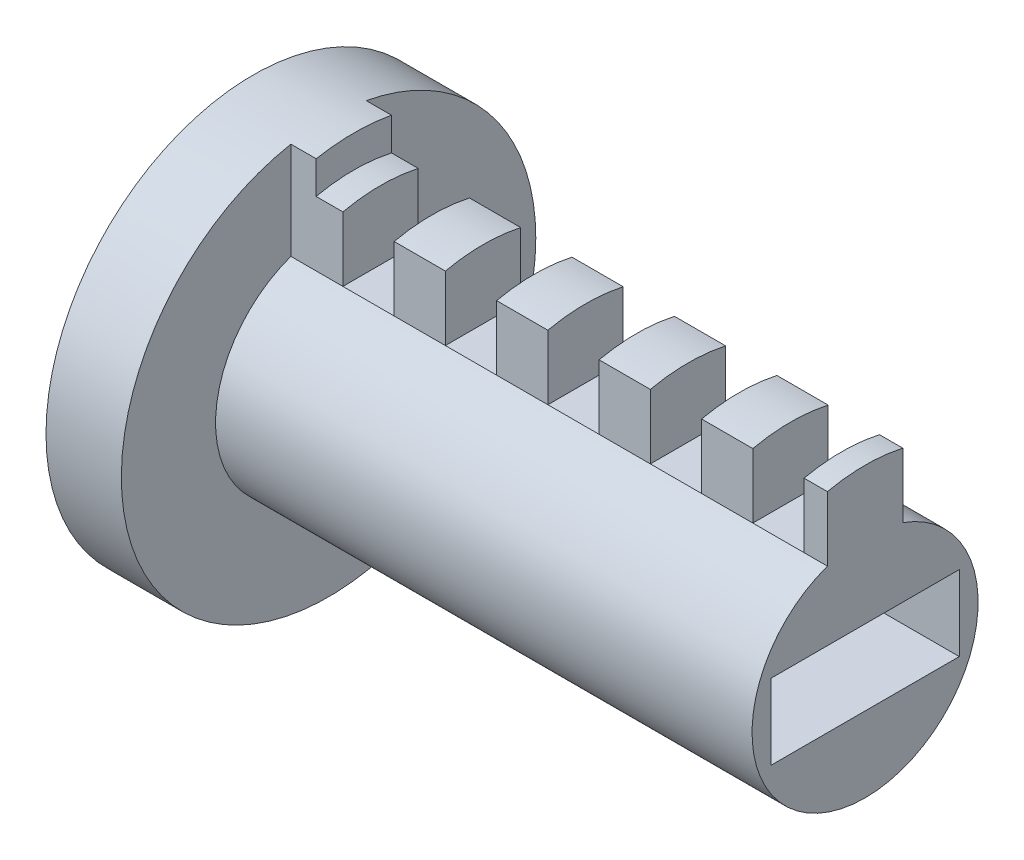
ISO-10303-21;
HEADER;
FILE_DESCRIPTION(('STEP AP214'),'2;1');
FILE_NAME('part.step','',(''),(''),'','','');
FILE_SCHEMA(('AUTOMOTIVE_DESIGN { 1 0 10303 214 1 1 1 1 }'));
ENDSEC;
DATA;
#1=APPLICATION_CONTEXT('core data for automotive mechanical design processes');
#2=APPLICATION_PROTOCOL_DEFINITION('international standard','automotive_design',2000,#1);
#3=PRODUCT_CONTEXT('',#1,'mechanical');
#4=PRODUCT('Part','Part','',(#3));
#5=PRODUCT_RELATED_PRODUCT_CATEGORY('part','',(#4));
#6=PRODUCT_DEFINITION_FORMATION('','',#4);
#7=PRODUCT_DEFINITION_CONTEXT('part definition',#1,'design');
#8=PRODUCT_DEFINITION('design','',#6,#7);
#9=PRODUCT_DEFINITION_SHAPE('','',#8);
#10=(LENGTH_UNIT() NAMED_UNIT(*) SI_UNIT(.MILLI.,.METRE.));
#11=(NAMED_UNIT(*) PLANE_ANGLE_UNIT() SI_UNIT($,.RADIAN.));
#12=(NAMED_UNIT(*) SI_UNIT($,.STERADIAN.) SOLID_ANGLE_UNIT());
#13=UNCERTAINTY_MEASURE_WITH_UNIT(LENGTH_MEASURE(1.E-05),#10,'distance_accuracy_value','');
#14=(GEOMETRIC_REPRESENTATION_CONTEXT(3) GLOBAL_UNCERTAINTY_ASSIGNED_CONTEXT((#13)) GLOBAL_UNIT_ASSIGNED_CONTEXT((#10,
#11,#12)) REPRESENTATION_CONTEXT('',''));
#15=CARTESIAN_POINT('',(0.,0.,0.));
#16=DIRECTION('',(0.,0.,1.));
#17=DIRECTION('',(1.,0.,0.));
#18=AXIS2_PLACEMENT_3D('',#15,#16,#17);
#19=CARTESIAN_POINT('',(38.1,0.,-2.54));
#20=DIRECTION('',(0.,0.,1.));
#21=DIRECTION('',(1.,0.,0.));
#22=AXIS2_PLACEMENT_3D('',#19,#20,#21);
#23=PLANE('',#22);
#24=DIRECTION('',(0.,-1.,0.));
#25=VECTOR('',#24,1.);
#26=CARTESIAN_POINT('',(6.9596,0.,-2.54));
#27=LINE('',#26,#25);
#28=CARTESIAN_POINT('',(6.9596,11.5346487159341,-2.54));
#29=VERTEX_POINT('',#28);
#30=CARTESIAN_POINT('',(6.9596,7.18420489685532,-2.54));
#31=VERTEX_POINT('',#30);
#32=EDGE_CURVE('E418',#29,#31,#27,.T.);
#33=ORIENTED_EDGE('',*,*,#32,.F.);
#34=DIRECTION('',(-1.,0.,0.));
#35=VECTOR('',#34,1.);
#36=CARTESIAN_POINT('',(38.1,11.5346487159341,-2.54));
#37=LINE('',#36,#35);
#38=CARTESIAN_POINT('',(10.414,11.5346487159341,-2.54));
#39=VERTEX_POINT('',#38);
#40=EDGE_CURVE('E566',#39,#29,#37,.T.);
#41=ORIENTED_EDGE('',*,*,#40,.F.);
#42=DIRECTION('',(0.,-1.,0.));
#43=VECTOR('',#42,1.);
#44=CARTESIAN_POINT('',(10.414,0.,-2.54));
#45=LINE('',#44,#43);
#46=CARTESIAN_POINT('',(10.414,7.18420489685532,-2.54));
#47=VERTEX_POINT('',#46);
#48=EDGE_CURVE('E408',#39,#47,#45,.T.);
#49=ORIENTED_EDGE('',*,*,#48,.T.);
#50=DIRECTION('',(-1.,0.,0.));
#51=VECTOR('',#50,1.);
#52=CARTESIAN_POINT('',(38.1,7.18420489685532,-2.54));
#53=LINE('',#52,#51);
#54=EDGE_CURVE('E574',#47,#31,#53,.T.);
#55=ORIENTED_EDGE('',*,*,#54,.T.);
#56=EDGE_LOOP('',(#33,#41,#49,#55));
#57=FACE_BOUND('',#56,.T.);
#58=ADVANCED_FACE('F42',(#57),#23,.F.);
#59=CARTESIAN_POINT('',(38.1,0.,0.));
#60=DIRECTION('',(-1.,0.,0.));
#61=DIRECTION('',(0.,0.,1.));
#62=AXIS2_PLACEMENT_3D('',#59,#60,#61);
#63=CYLINDRICAL_SURFACE('',#62,11.811);
#64=CARTESIAN_POINT('',(6.9596,0.,0.));
#65=DIRECTION('',(-1.,0.,0.));
#66=DIRECTION('',(0.,0.,1.));
#67=AXIS2_PLACEMENT_3D('',#64,#65,#66);
#68=CIRCLE('',#67,11.811);
#69=CARTESIAN_POINT('',(6.9596,11.5346487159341,2.54));
#70=VERTEX_POINT('',#69);
#71=EDGE_CURVE('E422',#70,#29,#68,.T.);
#72=ORIENTED_EDGE('',*,*,#71,.F.);
#73=DIRECTION('',(-1.,0.,0.));
#74=VECTOR('',#73,1.);
#75=CARTESIAN_POINT('',(38.1,11.5346487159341,2.54));
#76=LINE('',#75,#74);
#77=CARTESIAN_POINT('',(10.414,11.5346487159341,2.54));
#78=VERTEX_POINT('',#77);
#79=EDGE_CURVE('E313',#78,#70,#76,.T.);
#80=ORIENTED_EDGE('',*,*,#79,.F.);
#81=CARTESIAN_POINT('',(10.414,0.,0.));
#82=DIRECTION('',(-1.,0.,0.));
#83=DIRECTION('',(0.,0.,1.));
#84=AXIS2_PLACEMENT_3D('',#81,#82,#83);
#85=CIRCLE('',#84,11.811);
#86=EDGE_CURVE('E411',#78,#39,#85,.T.);
#87=ORIENTED_EDGE('',*,*,#86,.T.);
#88=ORIENTED_EDGE('',*,*,#40,.T.);
#89=EDGE_LOOP('',(#72,#80,#87,#88));
#90=FACE_BOUND('',#89,.T.);
#91=ADVANCED_FACE('F493',(#90),#63,.T.);
#92=CARTESIAN_POINT('',(38.1,0.,2.54));
#93=DIRECTION('',(0.,0.,1.));
#94=DIRECTION('',(1.,0.,0.));
#95=AXIS2_PLACEMENT_3D('',#92,#93,#94);
#96=PLANE('',#95);
#97=ORIENTED_EDGE('',*,*,#79,.T.);
#98=DIRECTION('',(0.,-1.,0.));
#99=VECTOR('',#98,1.);
#100=CARTESIAN_POINT('',(6.9596,0.,2.54));
#101=LINE('',#100,#99);
#102=CARTESIAN_POINT('',(6.9596,7.18420489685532,2.54));
#103=VERTEX_POINT('',#102);
#104=EDGE_CURVE('E50',#70,#103,#101,.T.);
#105=ORIENTED_EDGE('',*,*,#104,.T.);
#106=DIRECTION('',(-1.,0.,0.));
#107=VECTOR('',#106,1.);
#108=CARTESIAN_POINT('',(38.1,7.18420489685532,2.54));
#109=LINE('',#108,#107);
#110=CARTESIAN_POINT('',(10.414,7.18420489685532,2.54));
#111=VERTEX_POINT('',#110);
#112=EDGE_CURVE('E310',#111,#103,#109,.T.);
#113=ORIENTED_EDGE('',*,*,#112,.F.);
#114=DIRECTION('',(0.,-1.,0.));
#115=VECTOR('',#114,1.);
#116=CARTESIAN_POINT('',(10.414,0.,2.54));
#117=LINE('',#116,#115);
#118=EDGE_CURVE('E297',#78,#111,#117,.T.);
#119=ORIENTED_EDGE('',*,*,#118,.F.);
#120=EDGE_LOOP('',(#97,#105,#113,#119));
#121=FACE_BOUND('',#120,.T.);
#122=ADVANCED_FACE('F308',(#121),#96,.T.);
#123=DIRECTION('',(0.,-1.,0.));
#124=VECTOR('',#123,1.);
#125=CARTESIAN_POINT('',(13.8684,0.,-2.54));
#126=LINE('',#125,#124);
#127=CARTESIAN_POINT('',(13.8684,11.5346487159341,-2.54));
#128=VERTEX_POINT('',#127);
#129=CARTESIAN_POINT('',(13.8684,7.18420489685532,-2.54));
#130=VERTEX_POINT('',#129);
#131=EDGE_CURVE('E399',#128,#130,#126,.T.);
#132=ORIENTED_EDGE('',*,*,#131,.F.);
#133=CARTESIAN_POINT('',(17.3228,11.5346487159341,-2.54));
#134=VERTEX_POINT('',#133);
#135=EDGE_CURVE('E563',#134,#128,#37,.T.);
#136=ORIENTED_EDGE('',*,*,#135,.F.);
#137=DIRECTION('',(0.,-1.,0.));
#138=VECTOR('',#137,1.);
#139=CARTESIAN_POINT('',(17.3228,0.,-2.54));
#140=LINE('',#139,#138);
#141=CARTESIAN_POINT('',(17.3228,7.18420489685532,-2.54));
#142=VERTEX_POINT('',#141);
#143=EDGE_CURVE('E389',#134,#142,#140,.T.);
#144=ORIENTED_EDGE('',*,*,#143,.T.);
#145=EDGE_CURVE('E583',#142,#130,#53,.T.);
#146=ORIENTED_EDGE('',*,*,#145,.T.);
#147=EDGE_LOOP('',(#132,#136,#144,#146));
#148=FACE_BOUND('',#147,.T.);
#149=ADVANCED_FACE('F495',(#148),#23,.F.);
#150=CARTESIAN_POINT('',(13.8684,0.,0.));
#151=DIRECTION('',(-1.,0.,0.));
#152=DIRECTION('',(0.,0.,1.));
#153=AXIS2_PLACEMENT_3D('',#150,#151,#152);
#154=CIRCLE('',#153,11.811);
#155=CARTESIAN_POINT('',(13.8684,11.5346487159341,2.54));
#156=VERTEX_POINT('',#155);
#157=EDGE_CURVE('E403',#156,#128,#154,.T.);
#158=ORIENTED_EDGE('',*,*,#157,.F.);
#159=CARTESIAN_POINT('',(17.3228,11.5346487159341,2.54));
#160=VERTEX_POINT('',#159);
#161=EDGE_CURVE('E603',#160,#156,#76,.T.);
#162=ORIENTED_EDGE('',*,*,#161,.F.);
#163=CARTESIAN_POINT('',(17.3228,0.,0.));
#164=DIRECTION('',(-1.,0.,0.));
#165=DIRECTION('',(0.,0.,1.));
#166=AXIS2_PLACEMENT_3D('',#163,#164,#165);
#167=CIRCLE('',#166,11.811);
#168=EDGE_CURVE('E392',#160,#134,#167,.T.);
#169=ORIENTED_EDGE('',*,*,#168,.T.);
#170=ORIENTED_EDGE('',*,*,#135,.T.);
#171=EDGE_LOOP('',(#158,#162,#169,#170));
#172=FACE_BOUND('',#171,.T.);
#173=ADVANCED_FACE('F502',(#172),#63,.T.);
#174=ORIENTED_EDGE('',*,*,#161,.T.);
#175=DIRECTION('',(0.,-1.,0.));
#176=VECTOR('',#175,1.);
#177=CARTESIAN_POINT('',(13.8684,0.,2.54));
#178=LINE('',#177,#176);
#179=CARTESIAN_POINT('',(13.8684,7.18420489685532,2.54));
#180=VERTEX_POINT('',#179);
#181=EDGE_CURVE('E299',#156,#180,#178,.T.);
#182=ORIENTED_EDGE('',*,*,#181,.T.);
#183=CARTESIAN_POINT('',(17.3228,7.18420489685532,2.54));
#184=VERTEX_POINT('',#183);
#185=EDGE_CURVE('E322',#184,#180,#109,.T.);
#186=ORIENTED_EDGE('',*,*,#185,.F.);
#187=DIRECTION('',(0.,-1.,0.));
#188=VECTOR('',#187,1.);
#189=CARTESIAN_POINT('',(17.3228,0.,2.54));
#190=LINE('',#189,#188);
#191=EDGE_CURVE('E292',#160,#184,#190,.T.);
#192=ORIENTED_EDGE('',*,*,#191,.F.);
#193=EDGE_LOOP('',(#174,#182,#186,#192));
#194=FACE_BOUND('',#193,.T.);
#195=ADVANCED_FACE('F541',(#194),#96,.T.);
#196=DIRECTION('',(0.,-1.,0.));
#197=VECTOR('',#196,1.);
#198=CARTESIAN_POINT('',(20.7772,0.,-2.54));
#199=LINE('',#198,#197);
#200=CARTESIAN_POINT('',(20.7772,11.5346487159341,-2.54));
#201=VERTEX_POINT('',#200);
#202=CARTESIAN_POINT('',(20.7772,7.18420489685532,-2.54));
#203=VERTEX_POINT('',#202);
#204=EDGE_CURVE('E380',#201,#203,#199,.T.);
#205=ORIENTED_EDGE('',*,*,#204,.F.);
#206=CARTESIAN_POINT('',(24.2316,11.5346487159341,-2.54));
#207=VERTEX_POINT('',#206);
#208=EDGE_CURVE('E555',#207,#201,#37,.T.);
#209=ORIENTED_EDGE('',*,*,#208,.F.);
#210=DIRECTION('',(0.,-1.,0.));
#211=VECTOR('',#210,1.);
#212=CARTESIAN_POINT('',(24.2316,0.,-2.54));
#213=LINE('',#212,#211);
#214=CARTESIAN_POINT('',(24.2316,7.18420489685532,-2.54));
#215=VERTEX_POINT('',#214);
#216=EDGE_CURVE('E370',#207,#215,#213,.T.);
#217=ORIENTED_EDGE('',*,*,#216,.T.);
#218=EDGE_CURVE('E557',#215,#203,#53,.T.);
#219=ORIENTED_EDGE('',*,*,#218,.T.);
#220=EDGE_LOOP('',(#205,#209,#217,#219));
#221=FACE_BOUND('',#220,.T.);
#222=ADVANCED_FACE('F507',(#221),#23,.F.);
#223=CARTESIAN_POINT('',(20.7772,0.,0.));
#224=DIRECTION('',(-1.,0.,0.));
#225=DIRECTION('',(0.,0.,1.));
#226=AXIS2_PLACEMENT_3D('',#223,#224,#225);
#227=CIRCLE('',#226,11.811);
#228=CARTESIAN_POINT('',(20.7772,11.5346487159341,2.54));
#229=VERTEX_POINT('',#228);
#230=EDGE_CURVE('E384',#229,#201,#227,.T.);
#231=ORIENTED_EDGE('',*,*,#230,.F.);
#232=CARTESIAN_POINT('',(24.2316,11.5346487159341,2.54));
#233=VERTEX_POINT('',#232);
#234=EDGE_CURVE('E599',#233,#229,#76,.T.);
#235=ORIENTED_EDGE('',*,*,#234,.F.);
#236=CARTESIAN_POINT('',(24.2316,0.,0.));
#237=DIRECTION('',(-1.,0.,0.));
#238=DIRECTION('',(0.,0.,1.));
#239=AXIS2_PLACEMENT_3D('',#236,#237,#238);
#240=CIRCLE('',#239,11.811);
#241=EDGE_CURVE('E373',#233,#207,#240,.T.);
#242=ORIENTED_EDGE('',*,*,#241,.T.);
#243=ORIENTED_EDGE('',*,*,#208,.T.);
#244=EDGE_LOOP('',(#231,#235,#242,#243));
#245=FACE_BOUND('',#244,.T.);
#246=ADVANCED_FACE('F539',(#245),#63,.T.);
#247=ORIENTED_EDGE('',*,*,#234,.T.);
#248=DIRECTION('',(0.,-1.,0.));
#249=VECTOR('',#248,1.);
#250=CARTESIAN_POINT('',(20.7772,0.,2.54));
#251=LINE('',#250,#249);
#252=CARTESIAN_POINT('',(20.7772,7.18420489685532,2.54));
#253=VERTEX_POINT('',#252);
#254=EDGE_CURVE('E294',#229,#253,#251,.T.);
#255=ORIENTED_EDGE('',*,*,#254,.T.);
#256=CARTESIAN_POINT('',(24.2316,7.18420489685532,2.54));
#257=VERTEX_POINT('',#256);
#258=EDGE_CURVE('E601',#257,#253,#109,.T.);
#259=ORIENTED_EDGE('',*,*,#258,.F.);
#260=DIRECTION('',(0.,-1.,0.));
#261=VECTOR('',#260,1.);
#262=CARTESIAN_POINT('',(24.2316,0.,2.54));
#263=LINE('',#262,#261);
#264=EDGE_CURVE('E287',#233,#257,#263,.T.);
#265=ORIENTED_EDGE('',*,*,#264,.F.);
#266=EDGE_LOOP('',(#247,#255,#259,#265));
#267=FACE_BOUND('',#266,.T.);
#268=ADVANCED_FACE('F530',(#267),#96,.T.);
#269=DIRECTION('',(0.,-1.,0.));
#270=VECTOR('',#269,1.);
#271=CARTESIAN_POINT('',(27.686,0.,-2.54));
#272=LINE('',#271,#270);
#273=CARTESIAN_POINT('',(27.686,11.5346487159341,-2.54));
#274=VERTEX_POINT('',#273);
#275=CARTESIAN_POINT('',(27.686,7.18420489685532,-2.54));
#276=VERTEX_POINT('',#275);
#277=EDGE_CURVE('E361',#274,#276,#272,.T.);
#278=ORIENTED_EDGE('',*,*,#277,.F.);
#279=CARTESIAN_POINT('',(31.1404,11.5346487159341,-2.54));
#280=VERTEX_POINT('',#279);
#281=EDGE_CURVE('E281',#280,#274,#37,.T.);
#282=ORIENTED_EDGE('',*,*,#281,.F.);
#283=DIRECTION('',(0.,-1.,0.));
#284=VECTOR('',#283,1.);
#285=CARTESIAN_POINT('',(31.1404,0.,-2.54));
#286=LINE('',#285,#284);
#287=CARTESIAN_POINT('',(31.1404,7.18420489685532,-2.54));
#288=VERTEX_POINT('',#287);
#289=EDGE_CURVE('E351',#280,#288,#286,.T.);
#290=ORIENTED_EDGE('',*,*,#289,.T.);
#291=EDGE_CURVE('E263',#288,#276,#53,.T.);
#292=ORIENTED_EDGE('',*,*,#291,.T.);
#293=EDGE_LOOP('',(#278,#282,#290,#292));
#294=FACE_BOUND('',#293,.T.);
#295=ADVANCED_FACE('F521',(#294),#23,.F.);
#296=CARTESIAN_POINT('',(27.686,0.,0.));
#297=DIRECTION('',(-1.,0.,0.));
#298=DIRECTION('',(0.,0.,1.));
#299=AXIS2_PLACEMENT_3D('',#296,#297,#298);
#300=CIRCLE('',#299,11.811);
#301=CARTESIAN_POINT('',(27.686,11.5346487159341,2.54));
#302=VERTEX_POINT('',#301);
#303=EDGE_CURVE('E365',#302,#274,#300,.T.);
#304=ORIENTED_EDGE('',*,*,#303,.F.);
#305=CARTESIAN_POINT('',(31.1404,11.5346487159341,2.54));
#306=VERTEX_POINT('',#305);
#307=EDGE_CURVE('E279',#306,#302,#76,.T.);
#308=ORIENTED_EDGE('',*,*,#307,.F.);
#309=CARTESIAN_POINT('',(31.1404,0.,0.));
#310=DIRECTION('',(-1.,0.,0.));
#311=DIRECTION('',(0.,0.,1.));
#312=AXIS2_PLACEMENT_3D('',#309,#310,#311);
#313=CIRCLE('',#312,11.811);
#314=EDGE_CURVE('E354',#306,#280,#313,.T.);
#315=ORIENTED_EDGE('',*,*,#314,.T.);
#316=ORIENTED_EDGE('',*,*,#281,.T.);
#317=EDGE_LOOP('',(#304,#308,#315,#316));
#318=FACE_BOUND('',#317,.T.);
#319=ADVANCED_FACE('F527',(#318),#63,.T.);
#320=ORIENTED_EDGE('',*,*,#307,.T.);
#321=DIRECTION('',(0.,-1.,0.));
#322=VECTOR('',#321,1.);
#323=CARTESIAN_POINT('',(27.686,0.,2.54));
#324=LINE('',#323,#322);
#325=CARTESIAN_POINT('',(27.686,7.18420489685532,2.54));
#326=VERTEX_POINT('',#325);
#327=EDGE_CURVE('E289',#302,#326,#324,.T.);
#328=ORIENTED_EDGE('',*,*,#327,.T.);
#329=CARTESIAN_POINT('',(31.1404,7.18420489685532,2.54));
#330=VERTEX_POINT('',#329);
#331=EDGE_CURVE('E697',#330,#326,#109,.T.);
#332=ORIENTED_EDGE('',*,*,#331,.F.);
#333=DIRECTION('',(0.,-1.,0.));
#334=VECTOR('',#333,1.);
#335=CARTESIAN_POINT('',(31.1404,0.,2.54));
#336=LINE('',#335,#334);
#337=EDGE_CURVE('E271',#306,#330,#336,.T.);
#338=ORIENTED_EDGE('',*,*,#337,.F.);
#339=EDGE_LOOP('',(#320,#328,#332,#338));
#340=FACE_BOUND('',#339,.T.);
#341=ADVANCED_FACE('F519',(#340),#96,.T.);
#342=CARTESIAN_POINT('',(36.1696,11.5346487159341,-2.54));
#343=VERTEX_POINT('',#342);
#344=CARTESIAN_POINT('',(34.5948,11.5346487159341,-2.54));
#345=VERTEX_POINT('',#344);
#346=EDGE_CURVE('E280',#343,#345,#37,.T.);
#347=ORIENTED_EDGE('',*,*,#346,.F.);
#348=DIRECTION('',(0.,-1.,0.));
#349=VECTOR('',#348,1.);
#350=CARTESIAN_POINT('',(36.1696,0.,-2.54));
#351=LINE('',#350,#349);
#352=CARTESIAN_POINT('',(36.1696,7.18420489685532,-2.54));
#353=VERTEX_POINT('',#352);
#354=EDGE_CURVE('E458',#343,#353,#351,.T.);
#355=ORIENTED_EDGE('',*,*,#354,.T.);
#356=CARTESIAN_POINT('',(34.5948,7.18420489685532,-2.54));
#357=VERTEX_POINT('',#356);
#358=EDGE_CURVE('E259',#353,#357,#53,.T.);
#359=ORIENTED_EDGE('',*,*,#358,.T.);
#360=DIRECTION('',(0.,-1.,0.));
#361=VECTOR('',#360,1.);
#362=CARTESIAN_POINT('',(34.5948,0.,-2.54));
#363=LINE('',#362,#361);
#364=EDGE_CURVE('E342',#345,#357,#363,.T.);
#365=ORIENTED_EDGE('',*,*,#364,.F.);
#366=EDGE_LOOP('',(#347,#355,#359,#365));
#367=FACE_BOUND('',#366,.T.);
#368=ADVANCED_FACE('F510',(#367),#23,.F.);
#369=CARTESIAN_POINT('',(36.1696,11.5346487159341,2.54));
#370=VERTEX_POINT('',#369);
#371=CARTESIAN_POINT('',(34.5948,11.5346487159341,2.54));
#372=VERTEX_POINT('',#371);
#373=EDGE_CURVE('E277',#370,#372,#76,.T.);
#374=ORIENTED_EDGE('',*,*,#373,.F.);
#375=CARTESIAN_POINT('',(36.1696,0.,0.));
#376=DIRECTION('',(-1.,0.,0.));
#377=DIRECTION('',(0.,0.,1.));
#378=AXIS2_PLACEMENT_3D('',#375,#376,#377);
#379=CIRCLE('',#378,11.811);
#380=EDGE_CURVE('E461',#370,#343,#379,.T.);
#381=ORIENTED_EDGE('',*,*,#380,.T.);
#382=ORIENTED_EDGE('',*,*,#346,.T.);
#383=CARTESIAN_POINT('',(34.5948,0.,0.));
#384=DIRECTION('',(-1.,0.,0.));
#385=DIRECTION('',(0.,0.,1.));
#386=AXIS2_PLACEMENT_3D('',#383,#384,#385);
#387=CIRCLE('',#386,11.811);
#388=EDGE_CURVE('E345',#372,#345,#387,.T.);
#389=ORIENTED_EDGE('',*,*,#388,.F.);
#390=EDGE_LOOP('',(#374,#381,#382,#389));
#391=FACE_BOUND('',#390,.T.);
#392=ADVANCED_FACE('F516',(#391),#63,.T.);
#393=DIRECTION('',(0.,-1.,0.));
#394=VECTOR('',#393,1.);
#395=CARTESIAN_POINT('',(36.1696,0.,2.54));
#396=LINE('',#395,#394);
#397=CARTESIAN_POINT('',(36.1696,7.18420489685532,2.54));
#398=VERTEX_POINT('',#397);
#399=EDGE_CURVE('E464',#370,#398,#396,.T.);
#400=ORIENTED_EDGE('',*,*,#399,.F.);
#401=ORIENTED_EDGE('',*,*,#373,.T.);
#402=DIRECTION('',(0.,-1.,0.));
#403=VECTOR('',#402,1.);
#404=CARTESIAN_POINT('',(34.5948,0.,2.54));
#405=LINE('',#404,#403);
#406=CARTESIAN_POINT('',(34.5948,7.18420489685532,2.54));
#407=VERTEX_POINT('',#406);
#408=EDGE_CURVE('E284',#372,#407,#405,.T.);
#409=ORIENTED_EDGE('',*,*,#408,.T.);
#410=EDGE_CURVE('E272',#398,#407,#109,.T.);
#411=ORIENTED_EDGE('',*,*,#410,.F.);
#412=EDGE_LOOP('',(#400,#401,#409,#411));
#413=FACE_BOUND('',#412,.T.);
#414=ADVANCED_FACE('F517',(#413),#96,.T.);
#415=CARTESIAN_POINT('',(38.1,0.,0.));
#416=DIRECTION('',(-1.,0.,0.));
#417=DIRECTION('',(0.,0.,1.));
#418=AXIS2_PLACEMENT_3D('',#415,#416,#417);
#419=CYLINDRICAL_SURFACE('',#418,7.62);
#420=CARTESIAN_POINT('',(36.1696,0.,0.));
#421=DIRECTION('',(-1.,0.,0.));
#422=DIRECTION('',(0.,0.,1.));
#423=AXIS2_PLACEMENT_3D('',#420,#421,#422);
#424=CIRCLE('',#423,7.62);
#425=EDGE_CURVE('E251',#353,#398,#424,.T.);
#426=ORIENTED_EDGE('',*,*,#425,.T.);
#427=ORIENTED_EDGE('',*,*,#410,.T.);
#428=EDGE_CURVE('E275',#407,#330,#109,.T.);
#429=ORIENTED_EDGE('',*,*,#428,.T.);
#430=ORIENTED_EDGE('',*,*,#331,.T.);
#431=EDGE_CURVE('E698',#326,#257,#109,.T.);
#432=ORIENTED_EDGE('',*,*,#431,.T.);
#433=ORIENTED_EDGE('',*,*,#258,.T.);
#434=EDGE_CURVE('E699',#253,#184,#109,.T.);
#435=ORIENTED_EDGE('',*,*,#434,.T.);
#436=ORIENTED_EDGE('',*,*,#185,.T.);
#437=EDGE_CURVE('E321',#180,#111,#109,.T.);
#438=ORIENTED_EDGE('',*,*,#437,.T.);
#439=ORIENTED_EDGE('',*,*,#112,.T.);
#440=CARTESIAN_POINT('',(3.5052,7.18420489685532,2.54));
#441=VERTEX_POINT('',#440);
#442=EDGE_CURVE('E319',#103,#441,#109,.T.);
#443=ORIENTED_EDGE('',*,*,#442,.T.);
#444=CARTESIAN_POINT('',(0.,7.18420489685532,2.54));
#445=VERTEX_POINT('',#444);
#446=EDGE_CURVE('E276',#441,#445,#109,.T.);
#447=ORIENTED_EDGE('',*,*,#446,.T.);
#448=CARTESIAN_POINT('',(0.,0.,0.));
#449=DIRECTION('',(1.,0.,0.));
#450=DIRECTION('',(0.,0.,-1.));
#451=AXIS2_PLACEMENT_3D('',#448,#449,#450);
#452=CIRCLE('',#451,7.62);
#453=CARTESIAN_POINT('',(0.,7.18420489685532,-2.54));
#454=VERTEX_POINT('',#453);
#455=EDGE_CURVE('E340',#445,#454,#452,.T.);
#456=ORIENTED_EDGE('',*,*,#455,.T.);
#457=CARTESIAN_POINT('',(3.5052,7.18420489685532,-2.54));
#458=VERTEX_POINT('',#457);
#459=EDGE_CURVE('E265',#458,#454,#53,.T.);
#460=ORIENTED_EDGE('',*,*,#459,.F.);
#461=DIRECTION('',(1.,0.,0.));
#462=VECTOR('',#461,1.);
#463=CARTESIAN_POINT('',(38.1,7.18420489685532,-2.54));
#464=LINE('',#463,#462);
#465=EDGE_CURVE('E424',#458,#31,#464,.T.);
#466=ORIENTED_EDGE('',*,*,#465,.T.);
#467=ORIENTED_EDGE('',*,*,#54,.F.);
#468=DIRECTION('',(1.,0.,0.));
#469=VECTOR('',#468,1.);
#470=CARTESIAN_POINT('',(38.1,7.18420489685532,-2.54));
#471=LINE('',#470,#469);
#472=EDGE_CURVE('E405',#47,#130,#471,.T.);
#473=ORIENTED_EDGE('',*,*,#472,.T.);
#474=ORIENTED_EDGE('',*,*,#145,.F.);
#475=DIRECTION('',(1.,0.,0.));
#476=VECTOR('',#475,1.);
#477=CARTESIAN_POINT('',(38.1,7.18420489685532,-2.54));
#478=LINE('',#477,#476);
#479=EDGE_CURVE('E386',#142,#203,#478,.T.);
#480=ORIENTED_EDGE('',*,*,#479,.T.);
#481=ORIENTED_EDGE('',*,*,#218,.F.);
#482=DIRECTION('',(1.,0.,0.));
#483=VECTOR('',#482,1.);
#484=CARTESIAN_POINT('',(38.1,7.18420489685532,-2.54));
#485=LINE('',#484,#483);
#486=EDGE_CURVE('E367',#215,#276,#485,.T.);
#487=ORIENTED_EDGE('',*,*,#486,.T.);
#488=ORIENTED_EDGE('',*,*,#291,.F.);
#489=DIRECTION('',(1.,0.,0.));
#490=VECTOR('',#489,1.);
#491=CARTESIAN_POINT('',(38.1,7.18420489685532,-2.54));
#492=LINE('',#491,#490);
#493=EDGE_CURVE('E348',#288,#357,#492,.T.);
#494=ORIENTED_EDGE('',*,*,#493,.T.);
#495=ORIENTED_EDGE('',*,*,#358,.F.);
#496=EDGE_LOOP('',(#426,#427,#429,#430,#432,#433,#435,#436,#438,#439,#443,#447,#456,#460,#466,
#467,#473,#474,#480,#481,#487,#488,#494,#495));
#497=FACE_BOUND('',#496,.T.);
#498=ADVANCED_FACE('F44',(#497),#419,.T.);
#499=CARTESIAN_POINT('',(3.5052,11.5346487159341,-2.54));
#500=VERTEX_POINT('',#499);
#501=CARTESIAN_POINT('',(1.70180000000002,11.5346487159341,-2.54));
#502=VERTEX_POINT('',#501);
#503=EDGE_CURVE('E64',#500,#502,#37,.T.);
#504=ORIENTED_EDGE('',*,*,#503,.F.);
#505=DIRECTION('',(0.,-1.,0.));
#506=VECTOR('',#505,1.);
#507=CARTESIAN_POINT('',(3.5052,0.,-2.54));
#508=LINE('',#507,#506);
#509=EDGE_CURVE('E427',#500,#458,#508,.T.);
#510=ORIENTED_EDGE('',*,*,#509,.T.);
#511=ORIENTED_EDGE('',*,*,#459,.T.);
#512=DIRECTION('',(0.,1.,0.));
#513=VECTOR('',#512,1.);
#514=CARTESIAN_POINT('',(0.,0.,-2.54));
#515=LINE('',#514,#513);
#516=CARTESIAN_POINT('',(0.,13.7371503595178,-2.54));
#517=VERTEX_POINT('',#516);
#518=EDGE_CURVE('E338',#454,#517,#515,.T.);
#519=ORIENTED_EDGE('',*,*,#518,.T.);
#520=DIRECTION('',(-1.,0.,0.));
#521=VECTOR('',#520,1.);
#522=CARTESIAN_POINT('',(1.7018,13.7371503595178,-2.54));
#523=LINE('',#522,#521);
#524=CARTESIAN_POINT('',(1.7018,13.7371503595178,-2.54));
#525=VERTEX_POINT('',#524);
#526=EDGE_CURVE('E441',#525,#517,#523,.T.);
#527=ORIENTED_EDGE('',*,*,#526,.F.);
#528=DIRECTION('',(0.,1.,0.));
#529=VECTOR('',#528,1.);
#530=CARTESIAN_POINT('',(1.7018,0.,-2.54));
#531=LINE('',#530,#529);
#532=EDGE_CURVE('E451',#502,#525,#531,.T.);
#533=ORIENTED_EDGE('',*,*,#532,.F.);
#534=EDGE_LOOP('',(#504,#510,#511,#519,#527,#533));
#535=FACE_BOUND('',#534,.T.);
#536=ADVANCED_FACE('F496',(#535),#23,.F.);
#537=ORIENTED_EDGE('',*,*,#503,.T.);
#538=CARTESIAN_POINT('',(1.7018,0.,0.));
#539=DIRECTION('',(1.,0.,0.));
#540=DIRECTION('',(0.,0.,-1.));
#541=AXIS2_PLACEMENT_3D('',#538,#539,#540);
#542=CIRCLE('',#541,11.811);
#543=CARTESIAN_POINT('',(1.70180000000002,11.5346487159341,2.54));
#544=VERTEX_POINT('',#543);
#545=EDGE_CURVE('E453',#544,#502,#542,.F.);
#546=ORIENTED_EDGE('',*,*,#545,.F.);
#547=CARTESIAN_POINT('',(3.50520000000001,11.5346487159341,2.54));
#548=VERTEX_POINT('',#547);
#549=EDGE_CURVE('E274',#548,#544,#76,.T.);
#550=ORIENTED_EDGE('',*,*,#549,.F.);
#551=CARTESIAN_POINT('',(3.5052,0.,0.));
#552=DIRECTION('',(-1.,0.,0.));
#553=DIRECTION('',(0.,0.,1.));
#554=AXIS2_PLACEMENT_3D('',#551,#552,#553);
#555=CIRCLE('',#554,11.811);
#556=EDGE_CURVE('E430',#548,#500,#555,.T.);
#557=ORIENTED_EDGE('',*,*,#556,.T.);
#558=EDGE_LOOP('',(#537,#546,#550,#557));
#559=FACE_BOUND('',#558,.T.);
#560=ADVANCED_FACE('F503',(#559),#63,.T.);
#561=DIRECTION('',(0.,-1.,0.));
#562=VECTOR('',#561,1.);
#563=CARTESIAN_POINT('',(3.5052,0.,2.54));
#564=LINE('',#563,#562);
#565=EDGE_CURVE('E302',#548,#441,#564,.T.);
#566=ORIENTED_EDGE('',*,*,#565,.F.);
#567=ORIENTED_EDGE('',*,*,#549,.T.);
#568=DIRECTION('',(0.,1.,0.));
#569=VECTOR('',#568,1.);
#570=CARTESIAN_POINT('',(1.7018,0.,2.54));
#571=LINE('',#570,#569);
#572=CARTESIAN_POINT('',(1.7018,13.7371503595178,2.54));
#573=VERTEX_POINT('',#572);
#574=EDGE_CURVE('E455',#544,#573,#571,.T.);
#575=ORIENTED_EDGE('',*,*,#574,.T.);
#576=DIRECTION('',(-1.,0.,0.));
#577=VECTOR('',#576,1.);
#578=CARTESIAN_POINT('',(1.7018,13.7371503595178,2.54));
#579=LINE('',#578,#577);
#580=CARTESIAN_POINT('',(0.,13.7371503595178,2.54));
#581=VERTEX_POINT('',#580);
#582=EDGE_CURVE('E446',#573,#581,#579,.T.);
#583=ORIENTED_EDGE('',*,*,#582,.T.);
#584=DIRECTION('',(0.,1.,0.));
#585=VECTOR('',#584,1.);
#586=CARTESIAN_POINT('',(0.,0.,2.54));
#587=LINE('',#586,#585);
#588=EDGE_CURVE('E336',#445,#581,#587,.T.);
#589=ORIENTED_EDGE('',*,*,#588,.F.);
#590=ORIENTED_EDGE('',*,*,#446,.F.);
#591=EDGE_LOOP('',(#566,#567,#575,#583,#589,#590));
#592=FACE_BOUND('',#591,.T.);
#593=ADVANCED_FACE('F515',(#592),#96,.T.);
#594=CARTESIAN_POINT('',(34.5948,0.,-13.97));
#595=DIRECTION('',(-1.,0.,0.));
#596=DIRECTION('',(0.,0.,1.));
#597=AXIS2_PLACEMENT_3D('',#594,#595,#596);
#598=PLANE('',#597);
#599=ORIENTED_EDGE('',*,*,#364,.T.);
#600=DIRECTION('',(0.,0.,1.));
#601=VECTOR('',#600,1.);
#602=CARTESIAN_POINT('',(34.5948,7.18420489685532,-13.97));
#603=LINE('',#602,#601);
#604=EDGE_CURVE('E357',#357,#407,#603,.T.);
#605=ORIENTED_EDGE('',*,*,#604,.T.);
#606=ORIENTED_EDGE('',*,*,#408,.F.);
#607=ORIENTED_EDGE('',*,*,#388,.T.);
#608=EDGE_LOOP('',(#599,#605,#606,#607));
#609=FACE_BOUND('',#608,.T.);
#610=ADVANCED_FACE('F664',(#609),#598,.T.);
#611=CARTESIAN_POINT('',(0.,7.18420489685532,-13.97));
#612=DIRECTION('',(0.,-1.,0.));
#613=DIRECTION('',(0.,0.,-1.));
#614=AXIS2_PLACEMENT_3D('',#611,#612,#613);
#615=PLANE('',#614);
#616=DIRECTION('',(0.,0.,1.));
#617=VECTOR('',#616,1.);
#618=CARTESIAN_POINT('',(31.1404,7.18420489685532,-13.97));
#619=LINE('',#618,#617);
#620=EDGE_CURVE('E358',#288,#330,#619,.T.);
#621=ORIENTED_EDGE('',*,*,#620,.T.);
#622=ORIENTED_EDGE('',*,*,#428,.F.);
#623=ORIENTED_EDGE('',*,*,#604,.F.);
#624=ORIENTED_EDGE('',*,*,#493,.F.);
#625=EDGE_LOOP('',(#621,#622,#623,#624));
#626=FACE_BOUND('',#625,.T.);
#627=ADVANCED_FACE('F661',(#626),#615,.F.);
#628=CARTESIAN_POINT('',(31.1404,0.,-13.97));
#629=DIRECTION('',(-1.,0.,0.));
#630=DIRECTION('',(0.,0.,1.));
#631=AXIS2_PLACEMENT_3D('',#628,#629,#630);
#632=PLANE('',#631);
#633=ORIENTED_EDGE('',*,*,#314,.F.);
#634=ORIENTED_EDGE('',*,*,#337,.T.);
#635=ORIENTED_EDGE('',*,*,#620,.F.);
#636=ORIENTED_EDGE('',*,*,#289,.F.);
#637=EDGE_LOOP('',(#633,#634,#635,#636));
#638=FACE_BOUND('',#637,.T.);
#639=ADVANCED_FACE('F655',(#638),#632,.F.);
#640=CARTESIAN_POINT('',(27.686,0.,-13.97));
#641=DIRECTION('',(-1.,0.,0.));
#642=DIRECTION('',(0.,0.,1.));
#643=AXIS2_PLACEMENT_3D('',#640,#641,#642);
#644=PLANE('',#643);
#645=ORIENTED_EDGE('',*,*,#277,.T.);
#646=DIRECTION('',(0.,0.,1.));
#647=VECTOR('',#646,1.);
#648=CARTESIAN_POINT('',(27.686,7.18420489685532,-13.97));
#649=LINE('',#648,#647);
#650=EDGE_CURVE('E377',#276,#326,#649,.T.);
#651=ORIENTED_EDGE('',*,*,#650,.T.);
#652=ORIENTED_EDGE('',*,*,#327,.F.);
#653=ORIENTED_EDGE('',*,*,#303,.T.);
#654=EDGE_LOOP('',(#645,#651,#652,#653));
#655=FACE_BOUND('',#654,.T.);
#656=ADVANCED_FACE('F652',(#655),#644,.T.);
#657=CARTESIAN_POINT('',(0.,7.18420489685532,-13.97));
#658=DIRECTION('',(0.,-1.,0.));
#659=DIRECTION('',(0.,0.,-1.));
#660=AXIS2_PLACEMENT_3D('',#657,#658,#659);
#661=PLANE('',#660);
#662=DIRECTION('',(0.,0.,1.));
#663=VECTOR('',#662,1.);
#664=CARTESIAN_POINT('',(24.2316,7.18420489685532,-13.97));
#665=LINE('',#664,#663);
#666=EDGE_CURVE('E376',#215,#257,#665,.T.);
#667=ORIENTED_EDGE('',*,*,#666,.T.);
#668=ORIENTED_EDGE('',*,*,#431,.F.);
#669=ORIENTED_EDGE('',*,*,#650,.F.);
#670=ORIENTED_EDGE('',*,*,#486,.F.);
#671=EDGE_LOOP('',(#667,#668,#669,#670));
#672=FACE_BOUND('',#671,.T.);
#673=ADVANCED_FACE('F594',(#672),#661,.F.);
#674=CARTESIAN_POINT('',(24.2316,0.,-13.97));
#675=DIRECTION('',(-1.,0.,0.));
#676=DIRECTION('',(0.,0.,1.));
#677=AXIS2_PLACEMENT_3D('',#674,#675,#676);
#678=PLANE('',#677);
#679=ORIENTED_EDGE('',*,*,#241,.F.);
#680=ORIENTED_EDGE('',*,*,#264,.T.);
#681=ORIENTED_EDGE('',*,*,#666,.F.);
#682=ORIENTED_EDGE('',*,*,#216,.F.);
#683=EDGE_LOOP('',(#679,#680,#681,#682));
#684=FACE_BOUND('',#683,.T.);
#685=ADVANCED_FACE('F597',(#684),#678,.F.);
#686=CARTESIAN_POINT('',(20.7772,0.,-13.97));
#687=DIRECTION('',(-1.,0.,0.));
#688=DIRECTION('',(0.,0.,1.));
#689=AXIS2_PLACEMENT_3D('',#686,#687,#688);
#690=PLANE('',#689);
#691=ORIENTED_EDGE('',*,*,#204,.T.);
#692=DIRECTION('',(0.,0.,1.));
#693=VECTOR('',#692,1.);
#694=CARTESIAN_POINT('',(20.7772,7.18420489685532,-13.97));
#695=LINE('',#694,#693);
#696=EDGE_CURVE('E396',#203,#253,#695,.T.);
#697=ORIENTED_EDGE('',*,*,#696,.T.);
#698=ORIENTED_EDGE('',*,*,#254,.F.);
#699=ORIENTED_EDGE('',*,*,#230,.T.);
#700=EDGE_LOOP('',(#691,#697,#698,#699));
#701=FACE_BOUND('',#700,.T.);
#702=ADVANCED_FACE('F648',(#701),#690,.T.);
#703=CARTESIAN_POINT('',(0.,7.18420489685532,-13.97));
#704=DIRECTION('',(0.,-1.,0.));
#705=DIRECTION('',(0.,0.,-1.));
#706=AXIS2_PLACEMENT_3D('',#703,#704,#705);
#707=PLANE('',#706);
#708=DIRECTION('',(0.,0.,1.));
#709=VECTOR('',#708,1.);
#710=CARTESIAN_POINT('',(17.3228,7.18420489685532,-13.97));
#711=LINE('',#710,#709);
#712=EDGE_CURVE('E395',#142,#184,#711,.T.);
#713=ORIENTED_EDGE('',*,*,#712,.T.);
#714=ORIENTED_EDGE('',*,*,#434,.F.);
#715=ORIENTED_EDGE('',*,*,#696,.F.);
#716=ORIENTED_EDGE('',*,*,#479,.F.);
#717=EDGE_LOOP('',(#713,#714,#715,#716));
#718=FACE_BOUND('',#717,.T.);
#719=ADVANCED_FACE('F644',(#718),#707,.F.);
#720=CARTESIAN_POINT('',(17.3228,0.,-13.97));
#721=DIRECTION('',(-1.,0.,0.));
#722=DIRECTION('',(0.,0.,1.));
#723=AXIS2_PLACEMENT_3D('',#720,#721,#722);
#724=PLANE('',#723);
#725=ORIENTED_EDGE('',*,*,#168,.F.);
#726=ORIENTED_EDGE('',*,*,#191,.T.);
#727=ORIENTED_EDGE('',*,*,#712,.F.);
#728=ORIENTED_EDGE('',*,*,#143,.F.);
#729=EDGE_LOOP('',(#725,#726,#727,#728));
#730=FACE_BOUND('',#729,.T.);
#731=ADVANCED_FACE('F633',(#730),#724,.F.);
#732=CARTESIAN_POINT('',(13.8684,0.,-13.97));
#733=DIRECTION('',(-1.,0.,0.));
#734=DIRECTION('',(0.,0.,1.));
#735=AXIS2_PLACEMENT_3D('',#732,#733,#734);
#736=PLANE('',#735);
#737=ORIENTED_EDGE('',*,*,#131,.T.);
#738=DIRECTION('',(0.,0.,1.));
#739=VECTOR('',#738,1.);
#740=CARTESIAN_POINT('',(13.8684,7.18420489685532,-13.97));
#741=LINE('',#740,#739);
#742=EDGE_CURVE('E415',#130,#180,#741,.T.);
#743=ORIENTED_EDGE('',*,*,#742,.T.);
#744=ORIENTED_EDGE('',*,*,#181,.F.);
#745=ORIENTED_EDGE('',*,*,#157,.T.);
#746=EDGE_LOOP('',(#737,#743,#744,#745));
#747=FACE_BOUND('',#746,.T.);
#748=ADVANCED_FACE('F629',(#747),#736,.T.);
#749=CARTESIAN_POINT('',(0.,7.18420489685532,-13.97));
#750=DIRECTION('',(0.,-1.,0.));
#751=DIRECTION('',(0.,0.,-1.));
#752=AXIS2_PLACEMENT_3D('',#749,#750,#751);
#753=PLANE('',#752);
#754=DIRECTION('',(0.,0.,1.));
#755=VECTOR('',#754,1.);
#756=CARTESIAN_POINT('',(10.414,7.18420489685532,-13.97));
#757=LINE('',#756,#755);
#758=EDGE_CURVE('E414',#47,#111,#757,.T.);
#759=ORIENTED_EDGE('',*,*,#758,.T.);
#760=ORIENTED_EDGE('',*,*,#437,.F.);
#761=ORIENTED_EDGE('',*,*,#742,.F.);
#762=ORIENTED_EDGE('',*,*,#472,.F.);
#763=EDGE_LOOP('',(#759,#760,#761,#762));
#764=FACE_BOUND('',#763,.T.);
#765=ADVANCED_FACE('F632',(#764),#753,.F.);
#766=CARTESIAN_POINT('',(10.414,0.,-13.97));
#767=DIRECTION('',(-1.,0.,0.));
#768=DIRECTION('',(0.,0.,1.));
#769=AXIS2_PLACEMENT_3D('',#766,#767,#768);
#770=PLANE('',#769);
#771=ORIENTED_EDGE('',*,*,#86,.F.);
#772=ORIENTED_EDGE('',*,*,#118,.T.);
#773=ORIENTED_EDGE('',*,*,#758,.F.);
#774=ORIENTED_EDGE('',*,*,#48,.F.);
#775=EDGE_LOOP('',(#771,#772,#773,#774));
#776=FACE_BOUND('',#775,.T.);
#777=ADVANCED_FACE('F635',(#776),#770,.F.);
#778=CARTESIAN_POINT('',(6.9596,0.,-13.97));
#779=DIRECTION('',(-1.,0.,0.));
#780=DIRECTION('',(0.,0.,1.));
#781=AXIS2_PLACEMENT_3D('',#778,#779,#780);
#782=PLANE('',#781);
#783=ORIENTED_EDGE('',*,*,#32,.T.);
#784=DIRECTION('',(0.,0.,1.));
#785=VECTOR('',#784,1.);
#786=CARTESIAN_POINT('',(6.9596,7.18420489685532,-13.97));
#787=LINE('',#786,#785);
#788=EDGE_CURVE('E433',#31,#103,#787,.T.);
#789=ORIENTED_EDGE('',*,*,#788,.T.);
#790=ORIENTED_EDGE('',*,*,#104,.F.);
#791=ORIENTED_EDGE('',*,*,#71,.T.);
#792=EDGE_LOOP('',(#783,#789,#790,#791));
#793=FACE_BOUND('',#792,.T.);
#794=ADVANCED_FACE('F576',(#793),#782,.T.);
#795=CARTESIAN_POINT('',(0.,7.18420489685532,-13.97));
#796=DIRECTION('',(0.,-1.,0.));
#797=DIRECTION('',(0.,0.,-1.));
#798=AXIS2_PLACEMENT_3D('',#795,#796,#797);
#799=PLANE('',#798);
#800=DIRECTION('',(0.,0.,1.));
#801=VECTOR('',#800,1.);
#802=CARTESIAN_POINT('',(3.5052,7.18420489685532,-13.97));
#803=LINE('',#802,#801);
#804=EDGE_CURVE('E432',#458,#441,#803,.T.);
#805=ORIENTED_EDGE('',*,*,#804,.T.);
#806=ORIENTED_EDGE('',*,*,#442,.F.);
#807=ORIENTED_EDGE('',*,*,#788,.F.);
#808=ORIENTED_EDGE('',*,*,#465,.F.);
#809=EDGE_LOOP('',(#805,#806,#807,#808));
#810=FACE_BOUND('',#809,.T.);
#811=ADVANCED_FACE('F578',(#810),#799,.F.);
#812=CARTESIAN_POINT('',(3.5052,0.,-13.97));
#813=DIRECTION('',(-1.,0.,0.));
#814=DIRECTION('',(0.,0.,1.));
#815=AXIS2_PLACEMENT_3D('',#812,#813,#814);
#816=PLANE('',#815);
#817=ORIENTED_EDGE('',*,*,#556,.F.);
#818=ORIENTED_EDGE('',*,*,#565,.T.);
#819=ORIENTED_EDGE('',*,*,#804,.F.);
#820=ORIENTED_EDGE('',*,*,#509,.F.);
#821=EDGE_LOOP('',(#817,#818,#819,#820));
#822=FACE_BOUND('',#821,.T.);
#823=ADVANCED_FACE('F490',(#822),#816,.F.);
#824=CARTESIAN_POINT('',(0.,0.,0.));
#825=DIRECTION('',(1.,0.,0.));
#826=DIRECTION('',(0.,0.,-1.));
#827=AXIS2_PLACEMENT_3D('',#824,#825,#826);
#828=PLANE('',#827);
#829=ORIENTED_EDGE('',*,*,#588,.T.);
#830=CARTESIAN_POINT('',(0.,0.,0.));
#831=DIRECTION('',(1.,0.,0.));
#832=DIRECTION('',(0.,0.,-1.));
#833=AXIS2_PLACEMENT_3D('',#830,#831,#832);
#834=CIRCLE('',#833,13.97);
#835=EDGE_CURVE('E438',#581,#517,#834,.T.);
#836=ORIENTED_EDGE('',*,*,#835,.T.);
#837=ORIENTED_EDGE('',*,*,#518,.F.);
#838=ORIENTED_EDGE('',*,*,#455,.F.);
#839=EDGE_LOOP('',(#829,#836,#837,#838));
#840=FACE_BOUND('',#839,.T.);
#841=ADVANCED_FACE('F478',(#840),#828,.T.);
#842=CARTESIAN_POINT('',(-5.08,0.,0.));
#843=DIRECTION('',(1.,0.,0.));
#844=DIRECTION('',(0.,0.,-1.));
#845=AXIS2_PLACEMENT_3D('',#842,#843,#844);
#846=CYLINDRICAL_SURFACE('',#845,13.97);
#847=CARTESIAN_POINT('',(-5.08,0.,0.));
#848=DIRECTION('',(1.,0.,0.));
#849=DIRECTION('',(0.,0.,-1.));
#850=AXIS2_PLACEMENT_3D('',#847,#848,#849);
#851=CIRCLE('',#850,13.97);
#852=CARTESIAN_POINT('',(-5.08,0.,-13.97));
#853=VERTEX_POINT('',#852);
#854=EDGE_CURVE('E435',#853,#853,#851,.T.);
#855=ORIENTED_EDGE('',*,*,#854,.T.);
#856=EDGE_LOOP('',(#855));
#857=FACE_BOUND('',#856,.T.);
#858=ORIENTED_EDGE('',*,*,#835,.F.);
#859=ORIENTED_EDGE('',*,*,#582,.F.);
#860=CARTESIAN_POINT('',(1.7018,0.,0.));
#861=DIRECTION('',(1.,0.,0.));
#862=DIRECTION('',(0.,0.,-1.));
#863=AXIS2_PLACEMENT_3D('',#860,#861,#862);
#864=CIRCLE('',#863,13.97);
#865=EDGE_CURVE('E449',#525,#573,#864,.T.);
#866=ORIENTED_EDGE('',*,*,#865,.F.);
#867=ORIENTED_EDGE('',*,*,#526,.T.);
#868=EDGE_LOOP('',(#858,#859,#866,#867));
#869=FACE_BOUND('',#868,.T.);
#870=ADVANCED_FACE('F489',(#857,#869),#846,.T.);
#871=CARTESIAN_POINT('',(-5.08,0.,0.));
#872=DIRECTION('',(1.,0.,0.));
#873=DIRECTION('',(0.,0.,-1.));
#874=AXIS2_PLACEMENT_3D('',#871,#872,#873);
#875=PLANE('',#874);
#876=ORIENTED_EDGE('',*,*,#854,.F.);
#877=EDGE_LOOP('',(#876));
#878=FACE_BOUND('',#877,.T.);
#879=ADVANCED_FACE('F857',(#878),#875,.F.);
#880=CARTESIAN_POINT('',(1.7018,0.,0.));
#881=DIRECTION('',(1.,0.,0.));
#882=DIRECTION('',(0.,0.,-1.));
#883=AXIS2_PLACEMENT_3D('',#880,#881,#882);
#884=PLANE('',#883);
#885=ORIENTED_EDGE('',*,*,#574,.F.);
#886=ORIENTED_EDGE('',*,*,#545,.T.);
#887=ORIENTED_EDGE('',*,*,#532,.T.);
#888=ORIENTED_EDGE('',*,*,#865,.T.);
#889=EDGE_LOOP('',(#885,#886,#887,#888));
#890=FACE_BOUND('',#889,.T.);
#891=ADVANCED_FACE('F484',(#890),#884,.T.);
#892=CARTESIAN_POINT('',(36.1696,-7.62,-12.7));
#893=DIRECTION('',(-1.,0.,0.));
#894=DIRECTION('',(0.,0.,1.));
#895=AXIS2_PLACEMENT_3D('',#892,#893,#894);
#896=PLANE('',#895);
#897=DIRECTION('',(0.,0.,-1.));
#898=VECTOR('',#897,1.);
#899=CARTESIAN_POINT('',(36.1696,2.54,0.));
#900=LINE('',#899,#898);
#901=CARTESIAN_POINT('',(36.1696,2.54,6.35));
#902=VERTEX_POINT('',#901);
#903=CARTESIAN_POINT('',(36.1696,2.54,-6.35));
#904=VERTEX_POINT('',#903);
#905=EDGE_CURVE('E239',#902,#904,#900,.T.);
#906=ORIENTED_EDGE('',*,*,#905,.T.);
#907=DIRECTION('',(0.,-1.,0.));
#908=VECTOR('',#907,1.);
#909=CARTESIAN_POINT('',(36.1696,0.,-6.35));
#910=LINE('',#909,#908);
#911=CARTESIAN_POINT('',(36.1696,-2.54,-6.35));
#912=VERTEX_POINT('',#911);
#913=EDGE_CURVE('E252',#904,#912,#910,.T.);
#914=ORIENTED_EDGE('',*,*,#913,.T.);
#915=DIRECTION('',(0.,0.,-1.));
#916=VECTOR('',#915,1.);
#917=CARTESIAN_POINT('',(36.1696,-2.54,0.));
#918=LINE('',#917,#916);
#919=CARTESIAN_POINT('',(36.1696,-2.54,6.35));
#920=VERTEX_POINT('',#919);
#921=EDGE_CURVE('E57',#920,#912,#918,.T.);
#922=ORIENTED_EDGE('',*,*,#921,.F.);
#923=DIRECTION('',(0.,-1.,0.));
#924=VECTOR('',#923,1.);
#925=CARTESIAN_POINT('',(36.1696,0.,6.35));
#926=LINE('',#925,#924);
#927=EDGE_CURVE('E11',#902,#920,#926,.T.);
#928=ORIENTED_EDGE('',*,*,#927,.F.);
#929=EDGE_LOOP('',(#906,#914,#922,#928));
#930=FACE_BOUND('',#929,.T.);
#931=ORIENTED_EDGE('',*,*,#380,.F.);
#932=ORIENTED_EDGE('',*,*,#399,.T.);
#933=ORIENTED_EDGE('',*,*,#425,.F.);
#934=ORIENTED_EDGE('',*,*,#354,.F.);
#935=EDGE_LOOP('',(#931,#932,#933,#934));
#936=FACE_BOUND('',#935,.T.);
#937=ADVANCED_FACE('F237',(#930,#936),#896,.F.);
#938=DIRECTION('',(0.,1.,0.));
#939=VECTOR('',#938,1.);
#940=CARTESIAN_POINT('',(0.,0.,-6.35));
#941=LINE('',#940,#939);
#942=CARTESIAN_POINT('',(0.,-2.54,-6.35));
#943=VERTEX_POINT('',#942);
#944=CARTESIAN_POINT('',(0.,2.54,-6.35));
#945=VERTEX_POINT('',#944);
#946=EDGE_CURVE('E328',#943,#945,#941,.T.);
#947=ORIENTED_EDGE('',*,*,#946,.T.);
#948=DIRECTION('',(0.,0.,1.));
#949=VECTOR('',#948,1.);
#950=CARTESIAN_POINT('',(0.,2.54,0.));
#951=LINE('',#950,#949);
#952=CARTESIAN_POINT('',(0.,2.54,6.35));
#953=VERTEX_POINT('',#952);
#954=EDGE_CURVE('E332',#945,#953,#951,.T.);
#955=ORIENTED_EDGE('',*,*,#954,.T.);
#956=DIRECTION('',(0.,1.,0.));
#957=VECTOR('',#956,1.);
#958=CARTESIAN_POINT('',(0.,0.,6.35));
#959=LINE('',#958,#957);
#960=CARTESIAN_POINT('',(0.,-2.54,6.35));
#961=VERTEX_POINT('',#960);
#962=EDGE_CURVE('E257',#961,#953,#959,.T.);
#963=ORIENTED_EDGE('',*,*,#962,.F.);
#964=DIRECTION('',(0.,0.,1.));
#965=VECTOR('',#964,1.);
#966=CARTESIAN_POINT('',(0.,-2.54,0.));
#967=LINE('',#966,#965);
#968=EDGE_CURVE('E326',#943,#961,#967,.T.);
#969=ORIENTED_EDGE('',*,*,#968,.F.);
#970=EDGE_LOOP('',(#947,#955,#963,#969));
#971=FACE_BOUND('',#970,.T.);
#972=ADVANCED_FACE('F475',(#971),#828,.T.);
#973=CARTESIAN_POINT('',(38.1,0.,6.35));
#974=DIRECTION('',(0.,0.,1.));
#975=DIRECTION('',(1.,0.,0.));
#976=AXIS2_PLACEMENT_3D('',#973,#974,#975);
#977=PLANE('',#976);
#978=DIRECTION('',(-1.,0.,0.));
#979=VECTOR('',#978,1.);
#980=CARTESIAN_POINT('',(38.1,2.54,6.35));
#981=LINE('',#980,#979);
#982=EDGE_CURVE('E248',#902,#953,#981,.T.);
#983=ORIENTED_EDGE('',*,*,#982,.F.);
#984=ORIENTED_EDGE('',*,*,#927,.T.);
#985=DIRECTION('',(-1.,0.,0.));
#986=VECTOR('',#985,1.);
#987=CARTESIAN_POINT('',(38.1,-2.54,6.35));
#988=LINE('',#987,#986);
#989=EDGE_CURVE('E258',#920,#961,#988,.T.);
#990=ORIENTED_EDGE('',*,*,#989,.T.);
#991=ORIENTED_EDGE('',*,*,#962,.T.);
#992=EDGE_LOOP('',(#983,#984,#990,#991));
#993=FACE_BOUND('',#992,.T.);
#994=ADVANCED_FACE('F255',(#993),#977,.F.);
#995=CARTESIAN_POINT('',(38.1,-2.54,0.));
#996=DIRECTION('',(0.,-1.,0.));
#997=DIRECTION('',(0.,0.,-1.));
#998=AXIS2_PLACEMENT_3D('',#995,#996,#997);
#999=PLANE('',#998);
#1000=ORIENTED_EDGE('',*,*,#989,.F.);
#1001=ORIENTED_EDGE('',*,*,#921,.T.);
#1002=DIRECTION('',(-1.,0.,0.));
#1003=VECTOR('',#1002,1.);
#1004=CARTESIAN_POINT('',(38.1,-2.54,-6.35));
#1005=LINE('',#1004,#1003);
#1006=EDGE_CURVE('E261',#912,#943,#1005,.T.);
#1007=ORIENTED_EDGE('',*,*,#1006,.T.);
#1008=ORIENTED_EDGE('',*,*,#968,.T.);
#1009=EDGE_LOOP('',(#1000,#1001,#1007,#1008));
#1010=FACE_BOUND('',#1009,.T.);
#1011=ADVANCED_FACE('F470',(#1010),#999,.F.);
#1012=CARTESIAN_POINT('',(38.1,0.,-6.35));
#1013=DIRECTION('',(0.,0.,1.));
#1014=DIRECTION('',(1.,0.,0.));
#1015=AXIS2_PLACEMENT_3D('',#1012,#1013,#1014);
#1016=PLANE('',#1015);
#1017=ORIENTED_EDGE('',*,*,#913,.F.);
#1018=DIRECTION('',(-1.,0.,0.));
#1019=VECTOR('',#1018,1.);
#1020=CARTESIAN_POINT('',(38.1,2.54,-6.35));
#1021=LINE('',#1020,#1019);
#1022=EDGE_CURVE('E250',#904,#945,#1021,.T.);
#1023=ORIENTED_EDGE('',*,*,#1022,.T.);
#1024=ORIENTED_EDGE('',*,*,#946,.F.);
#1025=ORIENTED_EDGE('',*,*,#1006,.F.);
#1026=EDGE_LOOP('',(#1017,#1023,#1024,#1025));
#1027=FACE_BOUND('',#1026,.T.);
#1028=ADVANCED_FACE('F473',(#1027),#1016,.T.);
#1029=CARTESIAN_POINT('',(38.1,2.54,0.));
#1030=DIRECTION('',(0.,-1.,0.));
#1031=DIRECTION('',(0.,0.,-1.));
#1032=AXIS2_PLACEMENT_3D('',#1029,#1030,#1031);
#1033=PLANE('',#1032);
#1034=ORIENTED_EDGE('',*,*,#905,.F.);
#1035=ORIENTED_EDGE('',*,*,#982,.T.);
#1036=ORIENTED_EDGE('',*,*,#954,.F.);
#1037=ORIENTED_EDGE('',*,*,#1022,.F.);
#1038=EDGE_LOOP('',(#1034,#1035,#1036,#1037));
#1039=FACE_BOUND('',#1038,.T.);
#1040=ADVANCED_FACE('F246',(#1039),#1033,.T.);
#1041=CLOSED_SHELL('',(#58,#91,#122,#149,#173,#195,#222,#246,#268,#295,#319,#341,#368,#392,#414,
#498,#536,#560,#593,#610,#627,#639,#656,#673,#685,#702,#719,#731,#748,#765,#777,#794,#811,#823,
#841,#870,#879,#891,#937,#972,#994,#1011,#1028,#1040));
#1042=MANIFOLD_SOLID_BREP('B2',#1041);
#1043=ADVANCED_BREP_SHAPE_REPRESENTATION('',(#18,#1042),#14);
#1044=SHAPE_DEFINITION_REPRESENTATION(#9,#1043);
ENDSEC;
END-ISO-10303-21;
